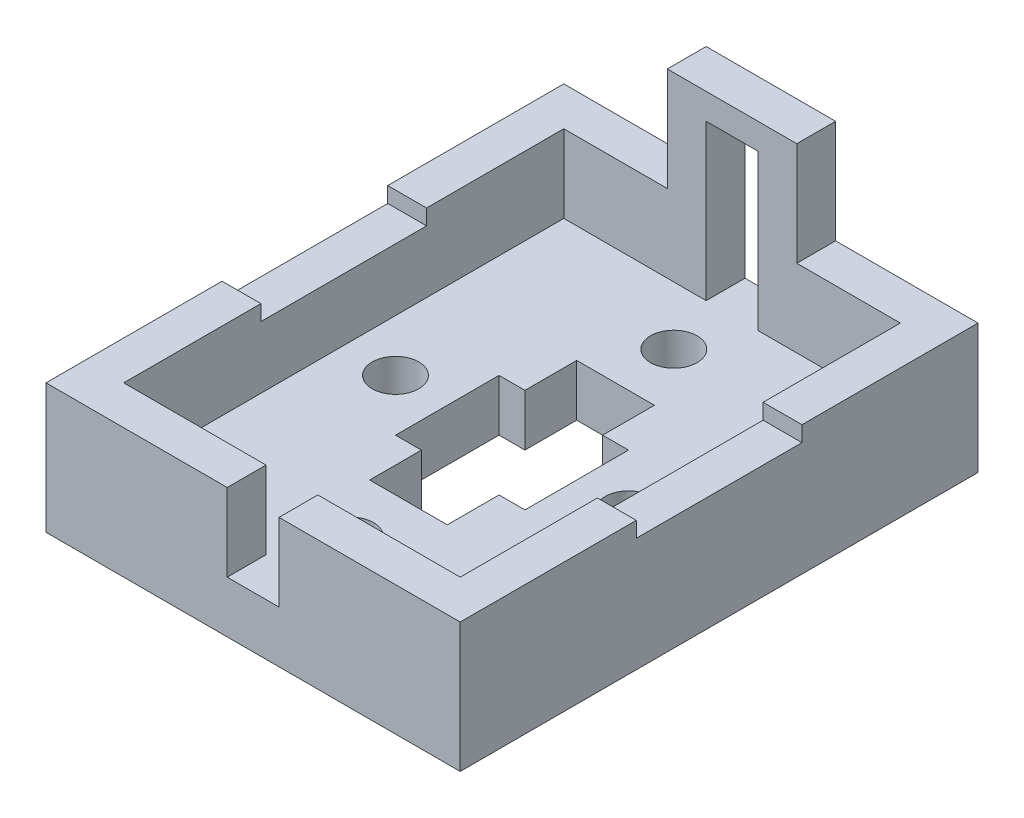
ISO-10303-21;
HEADER;
FILE_DESCRIPTION(('STEP AP214'),'2;1');
FILE_NAME('part.step','',(''),(''),'','','');
FILE_SCHEMA(('AUTOMOTIVE_DESIGN { 1 0 10303 214 1 1 1 1 }'));
ENDSEC;
DATA;
#1=APPLICATION_CONTEXT('core data for automotive mechanical design processes');
#2=APPLICATION_PROTOCOL_DEFINITION('international standard','automotive_design',2000,#1);
#3=PRODUCT_CONTEXT('',#1,'mechanical');
#4=PRODUCT('Part','Part','',(#3));
#5=PRODUCT_RELATED_PRODUCT_CATEGORY('part','',(#4));
#6=PRODUCT_DEFINITION_FORMATION('','',#4);
#7=PRODUCT_DEFINITION_CONTEXT('part definition',#1,'design');
#8=PRODUCT_DEFINITION('design','',#6,#7);
#9=PRODUCT_DEFINITION_SHAPE('','',#8);
#10=(LENGTH_UNIT() NAMED_UNIT(*) SI_UNIT(.MILLI.,.METRE.));
#11=(NAMED_UNIT(*) PLANE_ANGLE_UNIT() SI_UNIT($,.RADIAN.));
#12=(NAMED_UNIT(*) SI_UNIT($,.STERADIAN.) SOLID_ANGLE_UNIT());
#13=UNCERTAINTY_MEASURE_WITH_UNIT(LENGTH_MEASURE(1.E-05),#10,'distance_accuracy_value','');
#14=(GEOMETRIC_REPRESENTATION_CONTEXT(3) GLOBAL_UNCERTAINTY_ASSIGNED_CONTEXT((#13)) GLOBAL_UNIT_ASSIGNED_CONTEXT((#10,
#11,#12)) REPRESENTATION_CONTEXT('',''));
#15=CARTESIAN_POINT('',(0.,0.,0.));
#16=DIRECTION('',(0.,0.,1.));
#17=DIRECTION('',(1.,0.,0.));
#18=AXIS2_PLACEMENT_3D('',#15,#16,#17);
#19=CARTESIAN_POINT('',(0.,25.,-100.));
#20=DIRECTION('',(0.,-1.,0.));
#21=DIRECTION('',(0.,0.,-1.));
#22=AXIS2_PLACEMENT_3D('',#19,#20,#21);
#23=PLANE('',#22);
#24=DIRECTION('',(0.,0.,-1.));
#25=VECTOR('',#24,1.);
#26=CARTESIAN_POINT('',(35.,25.,-50.));
#27=LINE('',#26,#25);
#28=CARTESIAN_POINT('',(35.,25.,0.));
#29=VERTEX_POINT('',#28);
#30=CARTESIAN_POINT('',(35.,25.,-7.5));
#31=VERTEX_POINT('',#30);
#32=EDGE_CURVE('E530',#29,#31,#27,.T.);
#33=ORIENTED_EDGE('',*,*,#32,.T.);
#34=DIRECTION('',(1.,0.,0.));
#35=VECTOR('',#34,1.);
#36=CARTESIAN_POINT('',(7.5,25.,-7.5));
#37=LINE('',#36,#35);
#38=CARTESIAN_POINT('',(7.5,25.,-7.5));
#39=VERTEX_POINT('',#38);
#40=EDGE_CURVE('E392',#39,#31,#37,.T.);
#41=ORIENTED_EDGE('',*,*,#40,.F.);
#42=DIRECTION('',(0.,0.,1.));
#43=VECTOR('',#42,1.);
#44=CARTESIAN_POINT('',(7.5,25.,-92.5));
#45=LINE('',#44,#43);
#46=CARTESIAN_POINT('',(7.50000000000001,25.,-34.));
#47=VERTEX_POINT('',#46);
#48=EDGE_CURVE('E391',#47,#39,#45,.T.);
#49=ORIENTED_EDGE('',*,*,#48,.F.);
#50=DIRECTION('',(1.,0.,0.));
#51=VECTOR('',#50,1.);
#52=CARTESIAN_POINT('',(-59.7506578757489,25.,-34.));
#53=LINE('',#52,#51);
#54=CARTESIAN_POINT('',(0.,25.,-34.));
#55=VERTEX_POINT('',#54);
#56=EDGE_CURVE('E438',#55,#47,#53,.T.);
#57=ORIENTED_EDGE('',*,*,#56,.F.);
#58=DIRECTION('',(0.,0.,1.));
#59=VECTOR('',#58,1.);
#60=CARTESIAN_POINT('',(0.,25.,0.));
#61=LINE('',#60,#59);
#62=CARTESIAN_POINT('',(0.,25.,0.));
#63=VERTEX_POINT('',#62);
#64=EDGE_CURVE('E354',#55,#63,#61,.T.);
#65=ORIENTED_EDGE('',*,*,#64,.T.);
#66=DIRECTION('',(1.,0.,0.));
#67=VECTOR('',#66,1.);
#68=CARTESIAN_POINT('',(0.,25.,0.));
#69=LINE('',#68,#67);
#70=EDGE_CURVE('E359',#63,#29,#69,.T.);
#71=ORIENTED_EDGE('',*,*,#70,.T.);
#72=EDGE_LOOP('',(#33,#41,#49,#57,#65,#71));
#73=FACE_BOUND('',#72,.T.);
#74=ADVANCED_FACE('F37',(#73),#23,.F.);
#75=CARTESIAN_POINT('',(0.,25.,0.));
#76=DIRECTION('',(0.,0.,-1.));
#77=DIRECTION('',(-1.,0.,0.));
#78=AXIS2_PLACEMENT_3D('',#75,#76,#77);
#79=PLANE('',#78);
#80=DIRECTION('',(0.,1.,0.));
#81=VECTOR('',#80,1.);
#82=CARTESIAN_POINT('',(35.,10.,0.));
#83=LINE('',#82,#81);
#84=CARTESIAN_POINT('',(35.,10.,0.));
#85=VERTEX_POINT('',#84);
#86=EDGE_CURVE('E425',#85,#29,#83,.T.);
#87=ORIENTED_EDGE('',*,*,#86,.T.);
#88=ORIENTED_EDGE('',*,*,#70,.F.);
#89=DIRECTION('',(0.,-1.,0.));
#90=VECTOR('',#89,1.);
#91=CARTESIAN_POINT('',(0.,25.,0.));
#92=LINE('',#91,#90);
#93=CARTESIAN_POINT('',(0.,0.,0.));
#94=VERTEX_POINT('',#93);
#95=EDGE_CURVE('E11',#63,#94,#92,.T.);
#96=ORIENTED_EDGE('',*,*,#95,.T.);
#97=DIRECTION('',(1.,0.,0.));
#98=VECTOR('',#97,1.);
#99=CARTESIAN_POINT('',(0.,0.,0.));
#100=LINE('',#99,#98);
#101=CARTESIAN_POINT('',(80.,0.,0.));
#102=VERTEX_POINT('',#101);
#103=EDGE_CURVE('E348',#94,#102,#100,.T.);
#104=ORIENTED_EDGE('',*,*,#103,.T.);
#105=DIRECTION('',(0.,-1.,0.));
#106=VECTOR('',#105,1.);
#107=CARTESIAN_POINT('',(80.,25.,0.));
#108=LINE('',#107,#106);
#109=CARTESIAN_POINT('',(80.,25.,0.));
#110=VERTEX_POINT('',#109);
#111=EDGE_CURVE('E46',#110,#102,#108,.T.);
#112=ORIENTED_EDGE('',*,*,#111,.F.);
#113=CARTESIAN_POINT('',(45.,25.,0.));
#114=VERTEX_POINT('',#113);
#115=EDGE_CURVE('E358',#114,#110,#69,.T.);
#116=ORIENTED_EDGE('',*,*,#115,.F.);
#117=DIRECTION('',(0.,1.,0.));
#118=VECTOR('',#117,1.);
#119=CARTESIAN_POINT('',(45.,10.,0.));
#120=LINE('',#119,#118);
#121=CARTESIAN_POINT('',(45.,10.,0.));
#122=VERTEX_POINT('',#121);
#123=EDGE_CURVE('E547',#122,#114,#120,.T.);
#124=ORIENTED_EDGE('',*,*,#123,.F.);
#125=DIRECTION('',(1.,0.,0.));
#126=VECTOR('',#125,1.);
#127=CARTESIAN_POINT('',(-59.7506578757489,10.,0.));
#128=LINE('',#127,#126);
#129=EDGE_CURVE('E534',#85,#122,#128,.T.);
#130=ORIENTED_EDGE('',*,*,#129,.F.);
#131=EDGE_LOOP('',(#87,#88,#96,#104,#112,#116,#124,#130));
#132=FACE_BOUND('',#131,.T.);
#133=ADVANCED_FACE('F558',(#132),#79,.F.);
#134=CARTESIAN_POINT('',(7.5,10.,-7.5));
#135=DIRECTION('',(0.,0.,1.));
#136=DIRECTION('',(1.,0.,0.));
#137=AXIS2_PLACEMENT_3D('',#134,#135,#136);
#138=PLANE('',#137);
#139=DIRECTION('',(0.,1.,0.));
#140=VECTOR('',#139,1.);
#141=CARTESIAN_POINT('',(35.,10.,-7.5));
#142=LINE('',#141,#140);
#143=CARTESIAN_POINT('',(35.,10.,-7.5));
#144=VERTEX_POINT('',#143);
#145=EDGE_CURVE('E549',#144,#31,#142,.T.);
#146=ORIENTED_EDGE('',*,*,#145,.F.);
#147=DIRECTION('',(1.,0.,0.));
#148=VECTOR('',#147,1.);
#149=CARTESIAN_POINT('',(7.5,10.,-7.5));
#150=LINE('',#149,#148);
#151=CARTESIAN_POINT('',(7.5,10.,-7.5));
#152=VERTEX_POINT('',#151);
#153=EDGE_CURVE('E330',#152,#144,#150,.T.);
#154=ORIENTED_EDGE('',*,*,#153,.F.);
#155=DIRECTION('',(0.,1.,0.));
#156=VECTOR('',#155,1.);
#157=CARTESIAN_POINT('',(7.5,10.,-7.5));
#158=LINE('',#157,#156);
#159=EDGE_CURVE('E341',#152,#39,#158,.T.);
#160=ORIENTED_EDGE('',*,*,#159,.T.);
#161=ORIENTED_EDGE('',*,*,#40,.T.);
#162=EDGE_LOOP('',(#146,#154,#160,#161));
#163=FACE_BOUND('',#162,.T.);
#164=ADVANCED_FACE('F528',(#163),#138,.F.);
#165=CARTESIAN_POINT('',(45.,25.,-7.5));
#166=VERTEX_POINT('',#165);
#167=CARTESIAN_POINT('',(72.5,25.,-7.5));
#168=VERTEX_POINT('',#167);
#169=EDGE_CURVE('E390',#166,#168,#37,.T.);
#170=ORIENTED_EDGE('',*,*,#169,.F.);
#171=DIRECTION('',(0.,0.,-1.));
#172=VECTOR('',#171,1.);
#173=CARTESIAN_POINT('',(45.,25.,-50.));
#174=LINE('',#173,#172);
#175=EDGE_CURVE('E535',#114,#166,#174,.T.);
#176=ORIENTED_EDGE('',*,*,#175,.F.);
#177=ORIENTED_EDGE('',*,*,#115,.T.);
#178=DIRECTION('',(0.,0.,-1.));
#179=VECTOR('',#178,1.);
#180=CARTESIAN_POINT('',(80.,25.,0.));
#181=LINE('',#180,#179);
#182=CARTESIAN_POINT('',(80.,25.,-34.));
#183=VERTEX_POINT('',#182);
#184=EDGE_CURVE('E363',#110,#183,#181,.T.);
#185=ORIENTED_EDGE('',*,*,#184,.T.);
#186=DIRECTION('',(-1.,0.,0.));
#187=VECTOR('',#186,1.);
#188=CARTESIAN_POINT('',(-59.7506578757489,25.,-34.));
#189=LINE('',#188,#187);
#190=CARTESIAN_POINT('',(72.5,25.,-34.));
#191=VERTEX_POINT('',#190);
#192=EDGE_CURVE('E415',#183,#191,#189,.T.);
#193=ORIENTED_EDGE('',*,*,#192,.T.);
#194=DIRECTION('',(0.,0.,-1.));
#195=VECTOR('',#194,1.);
#196=CARTESIAN_POINT('',(72.5,25.,-7.5));
#197=LINE('',#196,#195);
#198=EDGE_CURVE('E326',#168,#191,#197,.T.);
#199=ORIENTED_EDGE('',*,*,#198,.F.);
#200=EDGE_LOOP('',(#170,#176,#177,#185,#193,#199));
#201=FACE_BOUND('',#200,.T.);
#202=ADVANCED_FACE('F414',(#201),#23,.F.);
#203=CARTESIAN_POINT('',(80.,25.,0.));
#204=DIRECTION('',(-1.,0.,0.));
#205=DIRECTION('',(0.,0.,1.));
#206=AXIS2_PLACEMENT_3D('',#203,#204,#205);
#207=PLANE('',#206);
#208=DIRECTION('',(0.,1.,0.));
#209=VECTOR('',#208,1.);
#210=CARTESIAN_POINT('',(80.,22.,-34.));
#211=LINE('',#210,#209);
#212=CARTESIAN_POINT('',(80.,22.,-34.));
#213=VERTEX_POINT('',#212);
#214=EDGE_CURVE('E436',#213,#183,#211,.T.);
#215=ORIENTED_EDGE('',*,*,#214,.T.);
#216=ORIENTED_EDGE('',*,*,#184,.F.);
#217=ORIENTED_EDGE('',*,*,#111,.T.);
#218=DIRECTION('',(0.,0.,-1.));
#219=VECTOR('',#218,1.);
#220=CARTESIAN_POINT('',(80.,0.,0.));
#221=LINE('',#220,#219);
#222=CARTESIAN_POINT('',(80.,0.,-100.));
#223=VERTEX_POINT('',#222);
#224=EDGE_CURVE('E350',#102,#223,#221,.T.);
#225=ORIENTED_EDGE('',*,*,#224,.T.);
#226=DIRECTION('',(0.,-1.,0.));
#227=VECTOR('',#226,1.);
#228=CARTESIAN_POINT('',(80.,25.,-100.));
#229=LINE('',#228,#227);
#230=CARTESIAN_POINT('',(80.,25.,-100.));
#231=VERTEX_POINT('',#230);
#232=EDGE_CURVE('E562',#231,#223,#229,.T.);
#233=ORIENTED_EDGE('',*,*,#232,.F.);
#234=CARTESIAN_POINT('',(80.,25.,-66.));
#235=VERTEX_POINT('',#234);
#236=EDGE_CURVE('E362',#235,#231,#181,.T.);
#237=ORIENTED_EDGE('',*,*,#236,.F.);
#238=DIRECTION('',(0.,1.,0.));
#239=VECTOR('',#238,1.);
#240=CARTESIAN_POINT('',(80.,22.,-66.));
#241=LINE('',#240,#239);
#242=CARTESIAN_POINT('',(80.,22.,-66.));
#243=VERTEX_POINT('',#242);
#244=EDGE_CURVE('E435',#243,#235,#241,.T.);
#245=ORIENTED_EDGE('',*,*,#244,.F.);
#246=DIRECTION('',(0.,0.,-1.));
#247=VECTOR('',#246,1.);
#248=CARTESIAN_POINT('',(80.,22.,-50.));
#249=LINE('',#248,#247);
#250=EDGE_CURVE('E419',#213,#243,#249,.T.);
#251=ORIENTED_EDGE('',*,*,#250,.F.);
#252=EDGE_LOOP('',(#215,#216,#217,#225,#233,#237,#245,#251));
#253=FACE_BOUND('',#252,.T.);
#254=ADVANCED_FACE('F564',(#253),#207,.F.);
#255=CARTESIAN_POINT('',(72.5,10.,-7.5));
#256=DIRECTION('',(1.,0.,0.));
#257=DIRECTION('',(0.,0.,-1.));
#258=AXIS2_PLACEMENT_3D('',#255,#256,#257);
#259=PLANE('',#258);
#260=DIRECTION('',(0.,1.,0.));
#261=VECTOR('',#260,1.);
#262=CARTESIAN_POINT('',(72.5,22.,-34.));
#263=LINE('',#262,#261);
#264=CARTESIAN_POINT('',(72.5,22.,-34.));
#265=VERTEX_POINT('',#264);
#266=EDGE_CURVE('E439',#265,#191,#263,.T.);
#267=ORIENTED_EDGE('',*,*,#266,.F.);
#268=DIRECTION('',(0.,0.,-1.));
#269=VECTOR('',#268,1.);
#270=CARTESIAN_POINT('',(72.5,22.,-50.));
#271=LINE('',#270,#269);
#272=CARTESIAN_POINT('',(72.5,22.,-66.));
#273=VERTEX_POINT('',#272);
#274=EDGE_CURVE('E430',#265,#273,#271,.T.);
#275=ORIENTED_EDGE('',*,*,#274,.T.);
#276=DIRECTION('',(0.,1.,0.));
#277=VECTOR('',#276,1.);
#278=CARTESIAN_POINT('',(72.5,22.,-66.));
#279=LINE('',#278,#277);
#280=CARTESIAN_POINT('',(72.5,25.,-66.));
#281=VERTEX_POINT('',#280);
#282=EDGE_CURVE('E441',#273,#281,#279,.T.);
#283=ORIENTED_EDGE('',*,*,#282,.T.);
#284=CARTESIAN_POINT('',(72.5,25.,-92.5));
#285=VERTEX_POINT('',#284);
#286=EDGE_CURVE('E394',#281,#285,#197,.T.);
#287=ORIENTED_EDGE('',*,*,#286,.T.);
#288=DIRECTION('',(0.,1.,0.));
#289=VECTOR('',#288,1.);
#290=CARTESIAN_POINT('',(72.5,10.,-92.5));
#291=LINE('',#290,#289);
#292=CARTESIAN_POINT('',(72.5,10.,-92.5));
#293=VERTEX_POINT('',#292);
#294=EDGE_CURVE('E335',#293,#285,#291,.T.);
#295=ORIENTED_EDGE('',*,*,#294,.F.);
#296=DIRECTION('',(0.,0.,-1.));
#297=VECTOR('',#296,1.);
#298=CARTESIAN_POINT('',(72.5,10.,-7.5));
#299=LINE('',#298,#297);
#300=CARTESIAN_POINT('',(72.5,10.,-7.5));
#301=VERTEX_POINT('',#300);
#302=EDGE_CURVE('E319',#301,#293,#299,.T.);
#303=ORIENTED_EDGE('',*,*,#302,.F.);
#304=DIRECTION('',(0.,1.,0.));
#305=VECTOR('',#304,1.);
#306=CARTESIAN_POINT('',(72.5,10.,-7.5));
#307=LINE('',#306,#305);
#308=EDGE_CURVE('E338',#301,#168,#307,.T.);
#309=ORIENTED_EDGE('',*,*,#308,.T.);
#310=ORIENTED_EDGE('',*,*,#198,.T.);
#311=EDGE_LOOP('',(#267,#275,#283,#287,#295,#303,#309,#310));
#312=FACE_BOUND('',#311,.T.);
#313=ADVANCED_FACE('F412',(#312),#259,.F.);
#314=DIRECTION('',(1.,0.,0.));
#315=VECTOR('',#314,1.);
#316=CARTESIAN_POINT('',(-59.7506578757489,25.,-66.));
#317=LINE('',#316,#315);
#318=CARTESIAN_POINT('',(0.,25.,-66.));
#319=VERTEX_POINT('',#318);
#320=CARTESIAN_POINT('',(7.50000000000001,25.,-66.));
#321=VERTEX_POINT('',#320);
#322=EDGE_CURVE('E446',#319,#321,#317,.T.);
#323=ORIENTED_EDGE('',*,*,#322,.T.);
#324=CARTESIAN_POINT('',(7.5,25.,-92.5));
#325=VERTEX_POINT('',#324);
#326=EDGE_CURVE('E387',#325,#321,#45,.T.);
#327=ORIENTED_EDGE('',*,*,#326,.F.);
#328=DIRECTION('',(-1.,0.,0.));
#329=VECTOR('',#328,1.);
#330=CARTESIAN_POINT('',(72.5,25.,-92.5));
#331=LINE('',#330,#329);
#332=CARTESIAN_POINT('',(27.5,25.,-92.5));
#333=VERTEX_POINT('',#332);
#334=EDGE_CURVE('E377',#333,#325,#331,.T.);
#335=ORIENTED_EDGE('',*,*,#334,.F.);
#336=DIRECTION('',(0.,0.,1.));
#337=VECTOR('',#336,1.);
#338=CARTESIAN_POINT('',(27.5,25.,-100.));
#339=LINE('',#338,#337);
#340=CARTESIAN_POINT('',(27.5,25.,-100.));
#341=VERTEX_POINT('',#340);
#342=EDGE_CURVE('E477',#341,#333,#339,.T.);
#343=ORIENTED_EDGE('',*,*,#342,.F.);
#344=DIRECTION('',(-1.,0.,0.));
#345=VECTOR('',#344,1.);
#346=CARTESIAN_POINT('',(0.,25.,-100.));
#347=LINE('',#346,#345);
#348=CARTESIAN_POINT('',(0.,25.,-100.));
#349=VERTEX_POINT('',#348);
#350=EDGE_CURVE('E366',#341,#349,#347,.T.);
#351=ORIENTED_EDGE('',*,*,#350,.T.);
#352=EDGE_CURVE('E355',#349,#319,#61,.T.);
#353=ORIENTED_EDGE('',*,*,#352,.T.);
#354=EDGE_LOOP('',(#323,#327,#335,#343,#351,#353));
#355=FACE_BOUND('',#354,.T.);
#356=ADVANCED_FACE('F598',(#355),#23,.F.);
#357=CARTESIAN_POINT('',(0.,25.,0.));
#358=DIRECTION('',(1.,0.,0.));
#359=DIRECTION('',(0.,0.,-1.));
#360=AXIS2_PLACEMENT_3D('',#357,#358,#359);
#361=PLANE('',#360);
#362=DIRECTION('',(0.,1.,0.));
#363=VECTOR('',#362,1.);
#364=CARTESIAN_POINT('',(0.,22.,-66.));
#365=LINE('',#364,#363);
#366=CARTESIAN_POINT('',(0.,22.,-66.));
#367=VERTEX_POINT('',#366);
#368=EDGE_CURVE('E460',#367,#319,#365,.T.);
#369=ORIENTED_EDGE('',*,*,#368,.T.);
#370=ORIENTED_EDGE('',*,*,#352,.F.);
#371=DIRECTION('',(0.,-1.,0.));
#372=VECTOR('',#371,1.);
#373=CARTESIAN_POINT('',(0.,25.,-100.));
#374=LINE('',#373,#372);
#375=CARTESIAN_POINT('',(0.,0.,-100.));
#376=VERTEX_POINT('',#375);
#377=EDGE_CURVE('E369',#349,#376,#374,.T.);
#378=ORIENTED_EDGE('',*,*,#377,.T.);
#379=DIRECTION('',(0.,0.,1.));
#380=VECTOR('',#379,1.);
#381=CARTESIAN_POINT('',(0.,0.,0.));
#382=LINE('',#381,#380);
#383=EDGE_CURVE('E337',#376,#94,#382,.T.);
#384=ORIENTED_EDGE('',*,*,#383,.T.);
#385=ORIENTED_EDGE('',*,*,#95,.F.);
#386=ORIENTED_EDGE('',*,*,#64,.F.);
#387=DIRECTION('',(0.,1.,0.));
#388=VECTOR('',#387,1.);
#389=CARTESIAN_POINT('',(0.,22.,-34.));
#390=LINE('',#389,#388);
#391=CARTESIAN_POINT('',(0.,22.,-34.));
#392=VERTEX_POINT('',#391);
#393=EDGE_CURVE('E459',#392,#55,#390,.T.);
#394=ORIENTED_EDGE('',*,*,#393,.F.);
#395=DIRECTION('',(0.,0.,1.));
#396=VECTOR('',#395,1.);
#397=CARTESIAN_POINT('',(0.,22.,-50.));
#398=LINE('',#397,#396);
#399=EDGE_CURVE('E449',#367,#392,#398,.T.);
#400=ORIENTED_EDGE('',*,*,#399,.F.);
#401=EDGE_LOOP('',(#369,#370,#378,#384,#385,#386,#394,#400));
#402=FACE_BOUND('',#401,.T.);
#403=ADVANCED_FACE('F39',(#402),#361,.F.);
#404=CARTESIAN_POINT('',(7.5,10.,-92.5));
#405=DIRECTION('',(-1.,0.,0.));
#406=DIRECTION('',(0.,0.,1.));
#407=AXIS2_PLACEMENT_3D('',#404,#405,#406);
#408=PLANE('',#407);
#409=DIRECTION('',(0.,1.,0.));
#410=VECTOR('',#409,1.);
#411=CARTESIAN_POINT('',(7.50000000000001,22.,-66.));
#412=LINE('',#411,#410);
#413=CARTESIAN_POINT('',(7.50000000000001,22.,-66.));
#414=VERTEX_POINT('',#413);
#415=EDGE_CURVE('E464',#414,#321,#412,.T.);
#416=ORIENTED_EDGE('',*,*,#415,.F.);
#417=DIRECTION('',(0.,0.,1.));
#418=VECTOR('',#417,1.);
#419=CARTESIAN_POINT('',(7.50000000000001,22.,-50.));
#420=LINE('',#419,#418);
#421=CARTESIAN_POINT('',(7.5,22.,-34.));
#422=VERTEX_POINT('',#421);
#423=EDGE_CURVE('E454',#414,#422,#420,.T.);
#424=ORIENTED_EDGE('',*,*,#423,.T.);
#425=DIRECTION('',(0.,1.,0.));
#426=VECTOR('',#425,1.);
#427=CARTESIAN_POINT('',(7.50000000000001,22.,-34.));
#428=LINE('',#427,#426);
#429=EDGE_CURVE('E466',#422,#47,#428,.T.);
#430=ORIENTED_EDGE('',*,*,#429,.T.);
#431=ORIENTED_EDGE('',*,*,#48,.T.);
#432=ORIENTED_EDGE('',*,*,#159,.F.);
#433=DIRECTION('',(0.,0.,1.));
#434=VECTOR('',#433,1.);
#435=CARTESIAN_POINT('',(7.5,10.,-92.5));
#436=LINE('',#435,#434);
#437=CARTESIAN_POINT('',(7.5,10.,-92.5));
#438=VERTEX_POINT('',#437);
#439=EDGE_CURVE('E320',#438,#152,#436,.T.);
#440=ORIENTED_EDGE('',*,*,#439,.F.);
#441=DIRECTION('',(0.,1.,0.));
#442=VECTOR('',#441,1.);
#443=CARTESIAN_POINT('',(7.5,10.,-92.5));
#444=LINE('',#443,#442);
#445=EDGE_CURVE('E334',#438,#325,#444,.T.);
#446=ORIENTED_EDGE('',*,*,#445,.T.);
#447=ORIENTED_EDGE('',*,*,#326,.T.);
#448=EDGE_LOOP('',(#416,#424,#430,#431,#432,#440,#446,#447));
#449=FACE_BOUND('',#448,.T.);
#450=ADVANCED_FACE('F522',(#449),#408,.F.);
#451=ORIENTED_EDGE('',*,*,#286,.F.);
#452=DIRECTION('',(-1.,0.,0.));
#453=VECTOR('',#452,1.);
#454=CARTESIAN_POINT('',(-59.7506578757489,25.,-66.));
#455=LINE('',#454,#453);
#456=EDGE_CURVE('E420',#235,#281,#455,.T.);
#457=ORIENTED_EDGE('',*,*,#456,.F.);
#458=ORIENTED_EDGE('',*,*,#236,.T.);
#459=CARTESIAN_POINT('',(52.5,25.,-100.));
#460=VERTEX_POINT('',#459);
#461=EDGE_CURVE('E375',#231,#460,#347,.T.);
#462=ORIENTED_EDGE('',*,*,#461,.T.);
#463=DIRECTION('',(0.,0.,-1.));
#464=VECTOR('',#463,1.);
#465=CARTESIAN_POINT('',(52.5,25.,-100.));
#466=LINE('',#465,#464);
#467=CARTESIAN_POINT('',(52.5,25.,-92.5));
#468=VERTEX_POINT('',#467);
#469=EDGE_CURVE('E463',#468,#460,#466,.T.);
#470=ORIENTED_EDGE('',*,*,#469,.F.);
#471=EDGE_CURVE('E380',#285,#468,#331,.T.);
#472=ORIENTED_EDGE('',*,*,#471,.F.);
#473=EDGE_LOOP('',(#451,#457,#458,#462,#470,#472));
#474=FACE_BOUND('',#473,.T.);
#475=ADVANCED_FACE('F518',(#474),#23,.F.);
#476=CARTESIAN_POINT('',(0.,25.,-100.));
#477=DIRECTION('',(0.,0.,1.));
#478=DIRECTION('',(1.,0.,0.));
#479=AXIS2_PLACEMENT_3D('',#476,#477,#478);
#480=PLANE('',#479);
#481=DIRECTION('',(0.,-1.,0.));
#482=VECTOR('',#481,1.);
#483=CARTESIAN_POINT('',(35.,25.,-100.));
#484=LINE('',#483,#482);
#485=CARTESIAN_POINT('',(35.,40.,-100.));
#486=VERTEX_POINT('',#485);
#487=CARTESIAN_POINT('',(35.,10.,-100.));
#488=VERTEX_POINT('',#487);
#489=EDGE_CURVE('E615',#486,#488,#484,.T.);
#490=ORIENTED_EDGE('',*,*,#489,.T.);
#491=DIRECTION('',(1.,0.,0.));
#492=VECTOR('',#491,1.);
#493=CARTESIAN_POINT('',(0.,10.,-100.));
#494=LINE('',#493,#492);
#495=CARTESIAN_POINT('',(45.,10.,-100.));
#496=VERTEX_POINT('',#495);
#497=EDGE_CURVE('E618',#488,#496,#494,.T.);
#498=ORIENTED_EDGE('',*,*,#497,.T.);
#499=DIRECTION('',(0.,1.,0.));
#500=VECTOR('',#499,1.);
#501=CARTESIAN_POINT('',(45.,25.,-100.));
#502=LINE('',#501,#500);
#503=CARTESIAN_POINT('',(45.,40.,-100.));
#504=VERTEX_POINT('',#503);
#505=EDGE_CURVE('E301',#496,#504,#502,.T.);
#506=ORIENTED_EDGE('',*,*,#505,.T.);
#507=DIRECTION('',(-1.,0.,0.));
#508=VECTOR('',#507,1.);
#509=CARTESIAN_POINT('',(0.,40.,-100.));
#510=LINE('',#509,#508);
#511=EDGE_CURVE('E612',#504,#486,#510,.T.);
#512=ORIENTED_EDGE('',*,*,#511,.T.);
#513=EDGE_LOOP('',(#490,#498,#506,#512));
#514=FACE_BOUND('',#513,.T.);
#515=DIRECTION('',(-1.,0.,0.));
#516=VECTOR('',#515,1.);
#517=CARTESIAN_POINT('',(0.,0.,-100.));
#518=LINE('',#517,#516);
#519=EDGE_CURVE('E352',#223,#376,#518,.T.);
#520=ORIENTED_EDGE('',*,*,#519,.T.);
#521=ORIENTED_EDGE('',*,*,#377,.F.);
#522=ORIENTED_EDGE('',*,*,#350,.F.);
#523=DIRECTION('',(0.,-1.,0.));
#524=VECTOR('',#523,1.);
#525=CARTESIAN_POINT('',(27.5,45.,-100.));
#526=LINE('',#525,#524);
#527=CARTESIAN_POINT('',(27.5,45.,-100.));
#528=VERTEX_POINT('',#527);
#529=EDGE_CURVE('E487',#528,#341,#526,.T.);
#530=ORIENTED_EDGE('',*,*,#529,.F.);
#531=DIRECTION('',(-1.,0.,0.));
#532=VECTOR('',#531,1.);
#533=CARTESIAN_POINT('',(52.5,45.,-100.));
#534=LINE('',#533,#532);
#535=CARTESIAN_POINT('',(52.5,45.,-100.));
#536=VERTEX_POINT('',#535);
#537=EDGE_CURVE('E493',#536,#528,#534,.T.);
#538=ORIENTED_EDGE('',*,*,#537,.F.);
#539=DIRECTION('',(0.,-1.,0.));
#540=VECTOR('',#539,1.);
#541=CARTESIAN_POINT('',(52.5,45.,-100.));
#542=LINE('',#541,#540);
#543=EDGE_CURVE('E381',#536,#460,#542,.T.);
#544=ORIENTED_EDGE('',*,*,#543,.T.);
#545=ORIENTED_EDGE('',*,*,#461,.F.);
#546=ORIENTED_EDGE('',*,*,#232,.T.);
#547=EDGE_LOOP('',(#520,#521,#522,#530,#538,#544,#545,#546));
#548=FACE_BOUND('',#547,.T.);
#549=ADVANCED_FACE('F510',(#514,#548),#480,.F.);
#550=CARTESIAN_POINT('',(0.,0.,-100.));
#551=DIRECTION('',(0.,-1.,0.));
#552=DIRECTION('',(0.,0.,-1.));
#553=AXIS2_PLACEMENT_3D('',#550,#551,#552);
#554=PLANE('',#553);
#555=CARTESIAN_POINT('',(17.5,0.,-50.));
#556=DIRECTION('',(0.,-1.,0.));
#557=DIRECTION('',(0.,0.,-1.));
#558=AXIS2_PLACEMENT_3D('',#555,#556,#557);
#559=CIRCLE('',#558,4.5);
#560=CARTESIAN_POINT('',(17.5,0.,-54.5));
#561=VERTEX_POINT('',#560);
#562=EDGE_CURVE('E809',#561,#561,#559,.T.);
#563=ORIENTED_EDGE('',*,*,#562,.F.);
#564=EDGE_LOOP('',(#563));
#565=FACE_BOUND('',#564,.T.);
#566=CARTESIAN_POINT('',(40.,0.,-81.25));
#567=DIRECTION('',(0.,-1.,0.));
#568=DIRECTION('',(0.,0.,-1.));
#569=AXIS2_PLACEMENT_3D('',#566,#567,#568);
#570=CIRCLE('',#569,4.5);
#571=CARTESIAN_POINT('',(40.,0.,-85.75));
#572=VERTEX_POINT('',#571);
#573=EDGE_CURVE('E813',#572,#572,#570,.T.);
#574=ORIENTED_EDGE('',*,*,#573,.F.);
#575=EDGE_LOOP('',(#574));
#576=FACE_BOUND('',#575,.T.);
#577=CARTESIAN_POINT('',(62.5,0.,-50.));
#578=DIRECTION('',(0.,-1.,0.));
#579=DIRECTION('',(0.,0.,-1.));
#580=AXIS2_PLACEMENT_3D('',#577,#578,#579);
#581=CIRCLE('',#580,4.5);
#582=CARTESIAN_POINT('',(62.5,0.,-54.5));
#583=VERTEX_POINT('',#582);
#584=EDGE_CURVE('E817',#583,#583,#581,.T.);
#585=ORIENTED_EDGE('',*,*,#584,.F.);
#586=EDGE_LOOP('',(#585));
#587=FACE_BOUND('',#586,.T.);
#588=CARTESIAN_POINT('',(40.,0.,-18.75));
#589=DIRECTION('',(0.,-1.,0.));
#590=DIRECTION('',(0.,0.,-1.));
#591=AXIS2_PLACEMENT_3D('',#588,#589,#590);
#592=CIRCLE('',#591,4.5);
#593=CARTESIAN_POINT('',(40.,0.,-23.25));
#594=VERTEX_POINT('',#593);
#595=EDGE_CURVE('E315',#594,#594,#592,.T.);
#596=ORIENTED_EDGE('',*,*,#595,.F.);
#597=EDGE_LOOP('',(#596));
#598=FACE_BOUND('',#597,.T.);
#599=DIRECTION('',(-1.,0.,0.));
#600=VECTOR('',#599,1.);
#601=CARTESIAN_POINT('',(27.5,0.,-60.));
#602=LINE('',#601,#600);
#603=CARTESIAN_POINT('',(32.5,0.,-60.));
#604=VERTEX_POINT('',#603);
#605=CARTESIAN_POINT('',(27.5,0.,-60.));
#606=VERTEX_POINT('',#605);
#607=EDGE_CURVE('E655',#604,#606,#602,.T.);
#608=ORIENTED_EDGE('',*,*,#607,.T.);
#609=DIRECTION('',(0.,0.,1.));
#610=VECTOR('',#609,1.);
#611=CARTESIAN_POINT('',(27.5,0.,-40.));
#612=LINE('',#611,#610);
#613=CARTESIAN_POINT('',(27.5,0.,-40.));
#614=VERTEX_POINT('',#613);
#615=EDGE_CURVE('E658',#606,#614,#612,.T.);
#616=ORIENTED_EDGE('',*,*,#615,.T.);
#617=DIRECTION('',(1.,0.,0.));
#618=VECTOR('',#617,1.);
#619=CARTESIAN_POINT('',(27.5,0.,-40.));
#620=LINE('',#619,#618);
#621=CARTESIAN_POINT('',(32.5,0.,-40.));
#622=VERTEX_POINT('',#621);
#623=EDGE_CURVE('E661',#614,#622,#620,.T.);
#624=ORIENTED_EDGE('',*,*,#623,.T.);
#625=DIRECTION('',(0.,0.,1.));
#626=VECTOR('',#625,1.);
#627=CARTESIAN_POINT('',(32.5,0.,-40.));
#628=LINE('',#627,#626);
#629=CARTESIAN_POINT('',(32.5,0.,-30.));
#630=VERTEX_POINT('',#629);
#631=EDGE_CURVE('E664',#622,#630,#628,.T.);
#632=ORIENTED_EDGE('',*,*,#631,.T.);
#633=DIRECTION('',(1.,0.,0.));
#634=VECTOR('',#633,1.);
#635=CARTESIAN_POINT('',(32.5,0.,-30.));
#636=LINE('',#635,#634);
#637=CARTESIAN_POINT('',(47.5,0.,-30.));
#638=VERTEX_POINT('',#637);
#639=EDGE_CURVE('E667',#630,#638,#636,.T.);
#640=ORIENTED_EDGE('',*,*,#639,.T.);
#641=DIRECTION('',(0.,0.,-1.));
#642=VECTOR('',#641,1.);
#643=CARTESIAN_POINT('',(47.5,0.,-40.));
#644=LINE('',#643,#642);
#645=CARTESIAN_POINT('',(47.5,0.,-40.));
#646=VERTEX_POINT('',#645);
#647=EDGE_CURVE('E670',#638,#646,#644,.T.);
#648=ORIENTED_EDGE('',*,*,#647,.T.);
#649=DIRECTION('',(1.,0.,0.));
#650=VECTOR('',#649,1.);
#651=CARTESIAN_POINT('',(52.5,0.,-40.));
#652=LINE('',#651,#650);
#653=CARTESIAN_POINT('',(52.5,0.,-40.));
#654=VERTEX_POINT('',#653);
#655=EDGE_CURVE('E673',#646,#654,#652,.T.);
#656=ORIENTED_EDGE('',*,*,#655,.T.);
#657=DIRECTION('',(0.,0.,-1.));
#658=VECTOR('',#657,1.);
#659=CARTESIAN_POINT('',(52.5,0.,-40.));
#660=LINE('',#659,#658);
#661=CARTESIAN_POINT('',(52.5,0.,-60.));
#662=VERTEX_POINT('',#661);
#663=EDGE_CURVE('E676',#654,#662,#660,.T.);
#664=ORIENTED_EDGE('',*,*,#663,.T.);
#665=DIRECTION('',(-1.,0.,0.));
#666=VECTOR('',#665,1.);
#667=CARTESIAN_POINT('',(52.5,0.,-60.));
#668=LINE('',#667,#666);
#669=CARTESIAN_POINT('',(47.5,0.,-60.));
#670=VERTEX_POINT('',#669);
#671=EDGE_CURVE('E679',#662,#670,#668,.T.);
#672=ORIENTED_EDGE('',*,*,#671,.T.);
#673=DIRECTION('',(0.,0.,-1.));
#674=VECTOR('',#673,1.);
#675=CARTESIAN_POINT('',(47.5,0.,-60.));
#676=LINE('',#675,#674);
#677=CARTESIAN_POINT('',(47.5,0.,-70.));
#678=VERTEX_POINT('',#677);
#679=EDGE_CURVE('E682',#670,#678,#676,.T.);
#680=ORIENTED_EDGE('',*,*,#679,.T.);
#681=DIRECTION('',(-1.,0.,0.));
#682=VECTOR('',#681,1.);
#683=CARTESIAN_POINT('',(32.5,0.,-70.));
#684=LINE('',#683,#682);
#685=CARTESIAN_POINT('',(32.5,0.,-70.));
#686=VERTEX_POINT('',#685);
#687=EDGE_CURVE('E685',#678,#686,#684,.T.);
#688=ORIENTED_EDGE('',*,*,#687,.T.);
#689=DIRECTION('',(0.,0.,1.));
#690=VECTOR('',#689,1.);
#691=CARTESIAN_POINT('',(32.5,0.,-60.));
#692=LINE('',#691,#690);
#693=EDGE_CURVE('E688',#686,#604,#692,.T.);
#694=ORIENTED_EDGE('',*,*,#693,.T.);
#695=EDGE_LOOP('',(#608,#616,#624,#632,#640,#648,#656,#664,#672,#680,#688,#694));
#696=FACE_BOUND('',#695,.T.);
#697=ORIENTED_EDGE('',*,*,#383,.F.);
#698=ORIENTED_EDGE('',*,*,#519,.F.);
#699=ORIENTED_EDGE('',*,*,#224,.F.);
#700=ORIENTED_EDGE('',*,*,#103,.F.);
#701=EDGE_LOOP('',(#697,#698,#699,#700));
#702=FACE_BOUND('',#701,.T.);
#703=ADVANCED_FACE('F586',(#565,#576,#587,#598,#696,#702),#554,.T.);
#704=CARTESIAN_POINT('',(72.5,10.,-92.5));
#705=DIRECTION('',(0.,0.,-1.));
#706=DIRECTION('',(-1.,0.,0.));
#707=AXIS2_PLACEMENT_3D('',#704,#705,#706);
#708=PLANE('',#707);
#709=DIRECTION('',(-1.,0.,0.));
#710=VECTOR('',#709,1.);
#711=CARTESIAN_POINT('',(72.5,10.,-92.5));
#712=LINE('',#711,#710);
#713=CARTESIAN_POINT('',(35.,10.,-92.5));
#714=VERTEX_POINT('',#713);
#715=EDGE_CURVE('E321',#714,#438,#712,.T.);
#716=ORIENTED_EDGE('',*,*,#715,.F.);
#717=DIRECTION('',(0.,-1.,0.));
#718=VECTOR('',#717,1.);
#719=CARTESIAN_POINT('',(35.,10.,-92.5));
#720=LINE('',#719,#718);
#721=CARTESIAN_POINT('',(35.,40.,-92.5));
#722=VERTEX_POINT('',#721);
#723=EDGE_CURVE('E62',#722,#714,#720,.T.);
#724=ORIENTED_EDGE('',*,*,#723,.F.);
#725=DIRECTION('',(-1.,0.,0.));
#726=VECTOR('',#725,1.);
#727=CARTESIAN_POINT('',(35.,40.,-92.5));
#728=LINE('',#727,#726);
#729=CARTESIAN_POINT('',(45.,40.,-92.5));
#730=VERTEX_POINT('',#729);
#731=EDGE_CURVE('E314',#730,#722,#728,.T.);
#732=ORIENTED_EDGE('',*,*,#731,.F.);
#733=DIRECTION('',(0.,1.,0.));
#734=VECTOR('',#733,1.);
#735=CARTESIAN_POINT('',(45.,10.,-92.5));
#736=LINE('',#735,#734);
#737=CARTESIAN_POINT('',(45.,10.,-92.5));
#738=VERTEX_POINT('',#737);
#739=EDGE_CURVE('E298',#738,#730,#736,.T.);
#740=ORIENTED_EDGE('',*,*,#739,.F.);
#741=EDGE_CURVE('E311',#293,#738,#712,.T.);
#742=ORIENTED_EDGE('',*,*,#741,.F.);
#743=ORIENTED_EDGE('',*,*,#294,.T.);
#744=ORIENTED_EDGE('',*,*,#471,.T.);
#745=DIRECTION('',(0.,-1.,0.));
#746=VECTOR('',#745,1.);
#747=CARTESIAN_POINT('',(52.5,45.,-92.5));
#748=LINE('',#747,#746);
#749=CARTESIAN_POINT('',(52.5,45.,-92.5));
#750=VERTEX_POINT('',#749);
#751=EDGE_CURVE('E480',#750,#468,#748,.T.);
#752=ORIENTED_EDGE('',*,*,#751,.F.);
#753=DIRECTION('',(1.,0.,0.));
#754=VECTOR('',#753,1.);
#755=CARTESIAN_POINT('',(27.5,45.,-92.5));
#756=LINE('',#755,#754);
#757=CARTESIAN_POINT('',(27.5,45.,-92.5));
#758=VERTEX_POINT('',#757);
#759=EDGE_CURVE('E385',#758,#750,#756,.T.);
#760=ORIENTED_EDGE('',*,*,#759,.F.);
#761=DIRECTION('',(0.,-1.,0.));
#762=VECTOR('',#761,1.);
#763=CARTESIAN_POINT('',(27.5,45.,-92.5));
#764=LINE('',#763,#762);
#765=EDGE_CURVE('E482',#758,#333,#764,.T.);
#766=ORIENTED_EDGE('',*,*,#765,.T.);
#767=ORIENTED_EDGE('',*,*,#334,.T.);
#768=ORIENTED_EDGE('',*,*,#445,.F.);
#769=EDGE_LOOP('',(#716,#724,#732,#740,#742,#743,#744,#752,#760,#766,#767,#768));
#770=FACE_BOUND('',#769,.T.);
#771=ADVANCED_FACE('F309',(#770),#708,.F.);
#772=CARTESIAN_POINT('',(45.,10.,-7.5));
#773=VERTEX_POINT('',#772);
#774=EDGE_CURVE('E324',#773,#301,#150,.T.);
#775=ORIENTED_EDGE('',*,*,#774,.F.);
#776=DIRECTION('',(0.,1.,0.));
#777=VECTOR('',#776,1.);
#778=CARTESIAN_POINT('',(45.,10.,-7.5));
#779=LINE('',#778,#777);
#780=EDGE_CURVE('E405',#773,#166,#779,.T.);
#781=ORIENTED_EDGE('',*,*,#780,.T.);
#782=ORIENTED_EDGE('',*,*,#169,.T.);
#783=ORIENTED_EDGE('',*,*,#308,.F.);
#784=EDGE_LOOP('',(#775,#781,#782,#783));
#785=FACE_BOUND('',#784,.T.);
#786=ADVANCED_FACE('F403',(#785),#138,.F.);
#787=CARTESIAN_POINT('',(7.5,10.,-92.5));
#788=DIRECTION('',(0.,1.,0.));
#789=DIRECTION('',(0.,0.,1.));
#790=AXIS2_PLACEMENT_3D('',#787,#788,#789);
#791=PLANE('',#790);
#792=CARTESIAN_POINT('',(17.5,10.,-50.));
#793=DIRECTION('',(0.,1.,0.));
#794=DIRECTION('',(0.,0.,1.));
#795=AXIS2_PLACEMENT_3D('',#792,#793,#794);
#796=CIRCLE('',#795,4.5);
#797=CARTESIAN_POINT('',(17.5,10.,-45.5));
#798=VERTEX_POINT('',#797);
#799=EDGE_CURVE('E835',#798,#798,#796,.T.);
#800=ORIENTED_EDGE('',*,*,#799,.F.);
#801=EDGE_LOOP('',(#800));
#802=FACE_BOUND('',#801,.T.);
#803=CARTESIAN_POINT('',(40.,10.,-81.25));
#804=DIRECTION('',(0.,1.,0.));
#805=DIRECTION('',(0.,0.,1.));
#806=AXIS2_PLACEMENT_3D('',#803,#804,#805);
#807=CIRCLE('',#806,4.5);
#808=CARTESIAN_POINT('',(40.,10.,-76.75));
#809=VERTEX_POINT('',#808);
#810=EDGE_CURVE('E831',#809,#809,#807,.T.);
#811=ORIENTED_EDGE('',*,*,#810,.F.);
#812=EDGE_LOOP('',(#811));
#813=FACE_BOUND('',#812,.T.);
#814=CARTESIAN_POINT('',(62.5,10.,-50.));
#815=DIRECTION('',(0.,1.,0.));
#816=DIRECTION('',(0.,0.,1.));
#817=AXIS2_PLACEMENT_3D('',#814,#815,#816);
#818=CIRCLE('',#817,4.5);
#819=CARTESIAN_POINT('',(62.5,10.,-45.5));
#820=VERTEX_POINT('',#819);
#821=EDGE_CURVE('E827',#820,#820,#818,.T.);
#822=ORIENTED_EDGE('',*,*,#821,.F.);
#823=EDGE_LOOP('',(#822));
#824=FACE_BOUND('',#823,.T.);
#825=CARTESIAN_POINT('',(40.,10.,-18.75));
#826=DIRECTION('',(0.,1.,0.));
#827=DIRECTION('',(0.,0.,1.));
#828=AXIS2_PLACEMENT_3D('',#825,#826,#827);
#829=CIRCLE('',#828,4.5);
#830=CARTESIAN_POINT('',(40.,10.,-14.25));
#831=VERTEX_POINT('',#830);
#832=EDGE_CURVE('E821',#831,#831,#829,.T.);
#833=ORIENTED_EDGE('',*,*,#832,.F.);
#834=EDGE_LOOP('',(#833));
#835=FACE_BOUND('',#834,.T.);
#836=DIRECTION('',(-1.,0.,0.));
#837=VECTOR('',#836,1.);
#838=CARTESIAN_POINT('',(27.5,10.,-60.));
#839=LINE('',#838,#837);
#840=CARTESIAN_POINT('',(32.5,10.,-60.));
#841=VERTEX_POINT('',#840);
#842=CARTESIAN_POINT('',(27.5,10.,-60.));
#843=VERTEX_POINT('',#842);
#844=EDGE_CURVE('E620',#841,#843,#839,.T.);
#845=ORIENTED_EDGE('',*,*,#844,.F.);
#846=DIRECTION('',(0.,0.,1.));
#847=VECTOR('',#846,1.);
#848=CARTESIAN_POINT('',(32.5,10.,-60.));
#849=LINE('',#848,#847);
#850=CARTESIAN_POINT('',(32.5,10.,-70.));
#851=VERTEX_POINT('',#850);
#852=EDGE_CURVE('E652',#851,#841,#849,.T.);
#853=ORIENTED_EDGE('',*,*,#852,.F.);
#854=DIRECTION('',(-1.,0.,0.));
#855=VECTOR('',#854,1.);
#856=CARTESIAN_POINT('',(32.5,10.,-70.));
#857=LINE('',#856,#855);
#858=CARTESIAN_POINT('',(47.5,10.,-70.));
#859=VERTEX_POINT('',#858);
#860=EDGE_CURVE('E649',#859,#851,#857,.T.);
#861=ORIENTED_EDGE('',*,*,#860,.F.);
#862=DIRECTION('',(0.,0.,-1.));
#863=VECTOR('',#862,1.);
#864=CARTESIAN_POINT('',(47.5,10.,-60.));
#865=LINE('',#864,#863);
#866=CARTESIAN_POINT('',(47.5,10.,-60.));
#867=VERTEX_POINT('',#866);
#868=EDGE_CURVE('E646',#867,#859,#865,.T.);
#869=ORIENTED_EDGE('',*,*,#868,.F.);
#870=DIRECTION('',(-1.,0.,0.));
#871=VECTOR('',#870,1.);
#872=CARTESIAN_POINT('',(52.5,10.,-60.));
#873=LINE('',#872,#871);
#874=CARTESIAN_POINT('',(52.5,10.,-60.));
#875=VERTEX_POINT('',#874);
#876=EDGE_CURVE('E643',#875,#867,#873,.T.);
#877=ORIENTED_EDGE('',*,*,#876,.F.);
#878=DIRECTION('',(0.,0.,-1.));
#879=VECTOR('',#878,1.);
#880=CARTESIAN_POINT('',(52.5,10.,-40.));
#881=LINE('',#880,#879);
#882=CARTESIAN_POINT('',(52.5,10.,-40.));
#883=VERTEX_POINT('',#882);
#884=EDGE_CURVE('E640',#883,#875,#881,.T.);
#885=ORIENTED_EDGE('',*,*,#884,.F.);
#886=DIRECTION('',(1.,0.,0.));
#887=VECTOR('',#886,1.);
#888=CARTESIAN_POINT('',(52.5,10.,-40.));
#889=LINE('',#888,#887);
#890=CARTESIAN_POINT('',(47.5,10.,-40.));
#891=VERTEX_POINT('',#890);
#892=EDGE_CURVE('E637',#891,#883,#889,.T.);
#893=ORIENTED_EDGE('',*,*,#892,.F.);
#894=DIRECTION('',(0.,0.,-1.));
#895=VECTOR('',#894,1.);
#896=CARTESIAN_POINT('',(47.5,10.,-40.));
#897=LINE('',#896,#895);
#898=CARTESIAN_POINT('',(47.5,10.,-30.));
#899=VERTEX_POINT('',#898);
#900=EDGE_CURVE('E634',#899,#891,#897,.T.);
#901=ORIENTED_EDGE('',*,*,#900,.F.);
#902=DIRECTION('',(1.,0.,0.));
#903=VECTOR('',#902,1.);
#904=CARTESIAN_POINT('',(32.5,10.,-30.));
#905=LINE('',#904,#903);
#906=CARTESIAN_POINT('',(32.5,10.,-30.));
#907=VERTEX_POINT('',#906);
#908=EDGE_CURVE('E631',#907,#899,#905,.T.);
#909=ORIENTED_EDGE('',*,*,#908,.F.);
#910=DIRECTION('',(0.,0.,1.));
#911=VECTOR('',#910,1.);
#912=CARTESIAN_POINT('',(32.5,10.,-40.));
#913=LINE('',#912,#911);
#914=CARTESIAN_POINT('',(32.5,10.,-40.));
#915=VERTEX_POINT('',#914);
#916=EDGE_CURVE('E628',#915,#907,#913,.T.);
#917=ORIENTED_EDGE('',*,*,#916,.F.);
#918=DIRECTION('',(1.,0.,0.));
#919=VECTOR('',#918,1.);
#920=CARTESIAN_POINT('',(27.5,10.,-40.));
#921=LINE('',#920,#919);
#922=CARTESIAN_POINT('',(27.5,10.,-40.));
#923=VERTEX_POINT('',#922);
#924=EDGE_CURVE('E625',#923,#915,#921,.T.);
#925=ORIENTED_EDGE('',*,*,#924,.F.);
#926=DIRECTION('',(0.,0.,1.));
#927=VECTOR('',#926,1.);
#928=CARTESIAN_POINT('',(27.5,10.,-40.));
#929=LINE('',#928,#927);
#930=EDGE_CURVE('E622',#843,#923,#929,.T.);
#931=ORIENTED_EDGE('',*,*,#930,.F.);
#932=EDGE_LOOP('',(#845,#853,#861,#869,#877,#885,#893,#901,#909,#917,#925,#931));
#933=FACE_BOUND('',#932,.T.);
#934=ORIENTED_EDGE('',*,*,#741,.T.);
#935=DIRECTION('',(0.,0.,1.));
#936=VECTOR('',#935,1.);
#937=CARTESIAN_POINT('',(45.,10.,-100.00005));
#938=LINE('',#937,#936);
#939=EDGE_CURVE('E295',#496,#738,#938,.T.);
#940=ORIENTED_EDGE('',*,*,#939,.F.);
#941=ORIENTED_EDGE('',*,*,#497,.F.);
#942=DIRECTION('',(0.,0.,1.));
#943=VECTOR('',#942,1.);
#944=CARTESIAN_POINT('',(35.,10.,-100.00005));
#945=LINE('',#944,#943);
#946=EDGE_CURVE('E603',#488,#714,#945,.T.);
#947=ORIENTED_EDGE('',*,*,#946,.T.);
#948=ORIENTED_EDGE('',*,*,#715,.T.);
#949=ORIENTED_EDGE('',*,*,#439,.T.);
#950=ORIENTED_EDGE('',*,*,#153,.T.);
#951=DIRECTION('',(0.,0.,-1.));
#952=VECTOR('',#951,1.);
#953=CARTESIAN_POINT('',(35.,10.,-50.));
#954=LINE('',#953,#952);
#955=EDGE_CURVE('E545',#85,#144,#954,.T.);
#956=ORIENTED_EDGE('',*,*,#955,.F.);
#957=ORIENTED_EDGE('',*,*,#129,.T.);
#958=DIRECTION('',(0.,0.,-1.));
#959=VECTOR('',#958,1.);
#960=CARTESIAN_POINT('',(45.,10.,-50.));
#961=LINE('',#960,#959);
#962=EDGE_CURVE('E538',#122,#773,#961,.T.);
#963=ORIENTED_EDGE('',*,*,#962,.T.);
#964=ORIENTED_EDGE('',*,*,#774,.T.);
#965=ORIENTED_EDGE('',*,*,#302,.T.);
#966=EDGE_LOOP('',(#934,#940,#941,#947,#948,#949,#950,#956,#957,#963,#964,#965));
#967=FACE_BOUND('',#966,.T.);
#968=ADVANCED_FACE('F317',(#802,#813,#824,#835,#933,#967),#791,.T.);
#969=CARTESIAN_POINT('',(52.5,45.,-100.));
#970=DIRECTION('',(-1.,0.,0.));
#971=DIRECTION('',(0.,0.,1.));
#972=AXIS2_PLACEMENT_3D('',#969,#970,#971);
#973=PLANE('',#972);
#974=ORIENTED_EDGE('',*,*,#469,.T.);
#975=ORIENTED_EDGE('',*,*,#543,.F.);
#976=DIRECTION('',(0.,0.,-1.));
#977=VECTOR('',#976,1.);
#978=CARTESIAN_POINT('',(52.5,45.,-100.));
#979=LINE('',#978,#977);
#980=EDGE_CURVE('E496',#750,#536,#979,.T.);
#981=ORIENTED_EDGE('',*,*,#980,.F.);
#982=ORIENTED_EDGE('',*,*,#751,.T.);
#983=EDGE_LOOP('',(#974,#975,#981,#982));
#984=FACE_BOUND('',#983,.T.);
#985=ADVANCED_FACE('F513',(#984),#973,.F.);
#986=CARTESIAN_POINT('',(27.5,45.,-100.));
#987=DIRECTION('',(1.,0.,0.));
#988=DIRECTION('',(0.,0.,-1.));
#989=AXIS2_PLACEMENT_3D('',#986,#987,#988);
#990=PLANE('',#989);
#991=ORIENTED_EDGE('',*,*,#342,.T.);
#992=ORIENTED_EDGE('',*,*,#765,.F.);
#993=DIRECTION('',(0.,0.,1.));
#994=VECTOR('',#993,1.);
#995=CARTESIAN_POINT('',(27.5,45.,-100.));
#996=LINE('',#995,#994);
#997=EDGE_CURVE('E489',#528,#758,#996,.T.);
#998=ORIENTED_EDGE('',*,*,#997,.F.);
#999=ORIENTED_EDGE('',*,*,#529,.T.);
#1000=EDGE_LOOP('',(#991,#992,#998,#999));
#1001=FACE_BOUND('',#1000,.T.);
#1002=ADVANCED_FACE('F600',(#1001),#990,.F.);
#1003=CARTESIAN_POINT('',(52.5,45.,-92.5));
#1004=DIRECTION('',(0.,1.,0.));
#1005=DIRECTION('',(0.,0.,1.));
#1006=AXIS2_PLACEMENT_3D('',#1003,#1004,#1005);
#1007=PLANE('',#1006);
#1008=ORIENTED_EDGE('',*,*,#980,.T.);
#1009=ORIENTED_EDGE('',*,*,#537,.T.);
#1010=ORIENTED_EDGE('',*,*,#997,.T.);
#1011=ORIENTED_EDGE('',*,*,#759,.T.);
#1012=EDGE_LOOP('',(#1008,#1009,#1010,#1011));
#1013=FACE_BOUND('',#1012,.T.);
#1014=ADVANCED_FACE('F996',(#1013),#1007,.T.);
#1015=CARTESIAN_POINT('',(-59.7506578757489,22.,-66.));
#1016=DIRECTION('',(0.,0.,1.));
#1017=DIRECTION('',(1.,0.,0.));
#1018=AXIS2_PLACEMENT_3D('',#1015,#1016,#1017);
#1019=PLANE('',#1018);
#1020=ORIENTED_EDGE('',*,*,#322,.F.);
#1021=ORIENTED_EDGE('',*,*,#368,.F.);
#1022=DIRECTION('',(1.,0.,0.));
#1023=VECTOR('',#1022,1.);
#1024=CARTESIAN_POINT('',(-59.7506578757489,22.,-66.));
#1025=LINE('',#1024,#1023);
#1026=EDGE_CURVE('E457',#367,#414,#1025,.T.);
#1027=ORIENTED_EDGE('',*,*,#1026,.T.);
#1028=ORIENTED_EDGE('',*,*,#415,.T.);
#1029=EDGE_LOOP('',(#1020,#1021,#1027,#1028));
#1030=FACE_BOUND('',#1029,.T.);
#1031=ADVANCED_FACE('F1003',(#1030),#1019,.T.);
#1032=CARTESIAN_POINT('',(-59.7506578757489,22.,-34.));
#1033=DIRECTION('',(0.,0.,1.));
#1034=DIRECTION('',(1.,0.,0.));
#1035=AXIS2_PLACEMENT_3D('',#1032,#1033,#1034);
#1036=PLANE('',#1035);
#1037=ORIENTED_EDGE('',*,*,#56,.T.);
#1038=ORIENTED_EDGE('',*,*,#429,.F.);
#1039=DIRECTION('',(1.,0.,0.));
#1040=VECTOR('',#1039,1.);
#1041=CARTESIAN_POINT('',(-59.7506578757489,22.,-34.));
#1042=LINE('',#1041,#1040);
#1043=EDGE_CURVE('E452',#392,#422,#1042,.T.);
#1044=ORIENTED_EDGE('',*,*,#1043,.F.);
#1045=ORIENTED_EDGE('',*,*,#393,.T.);
#1046=EDGE_LOOP('',(#1037,#1038,#1044,#1045));
#1047=FACE_BOUND('',#1046,.T.);
#1048=ADVANCED_FACE('F591',(#1047),#1036,.F.);
#1049=CARTESIAN_POINT('',(-59.7506578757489,22.,-50.));
#1050=DIRECTION('',(0.,1.,0.));
#1051=DIRECTION('',(0.,0.,1.));
#1052=AXIS2_PLACEMENT_3D('',#1049,#1050,#1051);
#1053=PLANE('',#1052);
#1054=ORIENTED_EDGE('',*,*,#399,.T.);
#1055=ORIENTED_EDGE('',*,*,#1043,.T.);
#1056=ORIENTED_EDGE('',*,*,#423,.F.);
#1057=ORIENTED_EDGE('',*,*,#1026,.F.);
#1058=EDGE_LOOP('',(#1054,#1055,#1056,#1057));
#1059=FACE_BOUND('',#1058,.T.);
#1060=ADVANCED_FACE('F595',(#1059),#1053,.T.);
#1061=CARTESIAN_POINT('',(-59.7506578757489,22.,-34.));
#1062=DIRECTION('',(0.,0.,-1.));
#1063=DIRECTION('',(-1.,0.,0.));
#1064=AXIS2_PLACEMENT_3D('',#1061,#1062,#1063);
#1065=PLANE('',#1064);
#1066=ORIENTED_EDGE('',*,*,#192,.F.);
#1067=ORIENTED_EDGE('',*,*,#214,.F.);
#1068=DIRECTION('',(-1.,0.,0.));
#1069=VECTOR('',#1068,1.);
#1070=CARTESIAN_POINT('',(-59.7506578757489,22.,-34.));
#1071=LINE('',#1070,#1069);
#1072=EDGE_CURVE('E433',#213,#265,#1071,.T.);
#1073=ORIENTED_EDGE('',*,*,#1072,.T.);
#1074=ORIENTED_EDGE('',*,*,#266,.T.);
#1075=EDGE_LOOP('',(#1066,#1067,#1073,#1074));
#1076=FACE_BOUND('',#1075,.T.);
#1077=ADVANCED_FACE('F568',(#1076),#1065,.T.);
#1078=CARTESIAN_POINT('',(-59.7506578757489,22.,-66.));
#1079=DIRECTION('',(0.,0.,-1.));
#1080=DIRECTION('',(-1.,0.,0.));
#1081=AXIS2_PLACEMENT_3D('',#1078,#1079,#1080);
#1082=PLANE('',#1081);
#1083=ORIENTED_EDGE('',*,*,#456,.T.);
#1084=ORIENTED_EDGE('',*,*,#282,.F.);
#1085=DIRECTION('',(-1.,0.,0.));
#1086=VECTOR('',#1085,1.);
#1087=CARTESIAN_POINT('',(-59.7506578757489,22.,-66.));
#1088=LINE('',#1087,#1086);
#1089=EDGE_CURVE('E423',#243,#273,#1088,.T.);
#1090=ORIENTED_EDGE('',*,*,#1089,.F.);
#1091=ORIENTED_EDGE('',*,*,#244,.T.);
#1092=EDGE_LOOP('',(#1083,#1084,#1090,#1091));
#1093=FACE_BOUND('',#1092,.T.);
#1094=ADVANCED_FACE('F1029',(#1093),#1082,.F.);
#1095=CARTESIAN_POINT('',(-59.7506578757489,22.,-50.));
#1096=DIRECTION('',(0.,1.,0.));
#1097=DIRECTION('',(0.,0.,1.));
#1098=AXIS2_PLACEMENT_3D('',#1095,#1096,#1097);
#1099=PLANE('',#1098);
#1100=ORIENTED_EDGE('',*,*,#250,.T.);
#1101=ORIENTED_EDGE('',*,*,#1089,.T.);
#1102=ORIENTED_EDGE('',*,*,#274,.F.);
#1103=ORIENTED_EDGE('',*,*,#1072,.F.);
#1104=EDGE_LOOP('',(#1100,#1101,#1102,#1103));
#1105=FACE_BOUND('',#1104,.T.);
#1106=ADVANCED_FACE('F571',(#1105),#1099,.T.);
#1107=CARTESIAN_POINT('',(35.,10.,-50.));
#1108=DIRECTION('',(1.,0.,0.));
#1109=DIRECTION('',(0.,0.,-1.));
#1110=AXIS2_PLACEMENT_3D('',#1107,#1108,#1109);
#1111=PLANE('',#1110);
#1112=ORIENTED_EDGE('',*,*,#32,.F.);
#1113=ORIENTED_EDGE('',*,*,#86,.F.);
#1114=ORIENTED_EDGE('',*,*,#955,.T.);
#1115=ORIENTED_EDGE('',*,*,#145,.T.);
#1116=EDGE_LOOP('',(#1112,#1113,#1114,#1115));
#1117=FACE_BOUND('',#1116,.T.);
#1118=ADVANCED_FACE('F1042',(#1117),#1111,.T.);
#1119=CARTESIAN_POINT('',(45.,10.,-50.));
#1120=DIRECTION('',(1.,0.,0.));
#1121=DIRECTION('',(0.,0.,-1.));
#1122=AXIS2_PLACEMENT_3D('',#1119,#1120,#1121);
#1123=PLANE('',#1122);
#1124=ORIENTED_EDGE('',*,*,#175,.T.);
#1125=ORIENTED_EDGE('',*,*,#780,.F.);
#1126=ORIENTED_EDGE('',*,*,#962,.F.);
#1127=ORIENTED_EDGE('',*,*,#123,.T.);
#1128=EDGE_LOOP('',(#1124,#1125,#1126,#1127));
#1129=FACE_BOUND('',#1128,.T.);
#1130=ADVANCED_FACE('F553',(#1129),#1123,.F.);
#1131=CARTESIAN_POINT('',(27.5,0.,-60.));
#1132=DIRECTION('',(0.,0.,-1.));
#1133=DIRECTION('',(-1.,0.,0.));
#1134=AXIS2_PLACEMENT_3D('',#1131,#1132,#1133);
#1135=PLANE('',#1134);
#1136=ORIENTED_EDGE('',*,*,#844,.T.);
#1137=DIRECTION('',(0.,1.,0.));
#1138=VECTOR('',#1137,1.);
#1139=CARTESIAN_POINT('',(27.5,0.,-60.));
#1140=LINE('',#1139,#1138);
#1141=EDGE_CURVE('E691',#606,#843,#1140,.T.);
#1142=ORIENTED_EDGE('',*,*,#1141,.F.);
#1143=ORIENTED_EDGE('',*,*,#607,.F.);
#1144=DIRECTION('',(0.,1.,0.));
#1145=VECTOR('',#1144,1.);
#1146=CARTESIAN_POINT('',(32.5,0.,-60.));
#1147=LINE('',#1146,#1145);
#1148=EDGE_CURVE('E540',#604,#841,#1147,.T.);
#1149=ORIENTED_EDGE('',*,*,#1148,.T.);
#1150=EDGE_LOOP('',(#1136,#1142,#1143,#1149));
#1151=FACE_BOUND('',#1150,.T.);
#1152=ADVANCED_FACE('F731',(#1151),#1135,.F.);
#1153=CARTESIAN_POINT('',(32.5,0.,-60.));
#1154=DIRECTION('',(-1.,0.,0.));
#1155=DIRECTION('',(0.,0.,1.));
#1156=AXIS2_PLACEMENT_3D('',#1153,#1154,#1155);
#1157=PLANE('',#1156);
#1158=ORIENTED_EDGE('',*,*,#852,.T.);
#1159=ORIENTED_EDGE('',*,*,#1148,.F.);
#1160=ORIENTED_EDGE('',*,*,#693,.F.);
#1161=DIRECTION('',(0.,1.,0.));
#1162=VECTOR('',#1161,1.);
#1163=CARTESIAN_POINT('',(32.5,0.,-70.));
#1164=LINE('',#1163,#1162);
#1165=EDGE_CURVE('E693',#686,#851,#1164,.T.);
#1166=ORIENTED_EDGE('',*,*,#1165,.T.);
#1167=EDGE_LOOP('',(#1158,#1159,#1160,#1166));
#1168=FACE_BOUND('',#1167,.T.);
#1169=ADVANCED_FACE('F733',(#1168),#1157,.F.);
#1170=CARTESIAN_POINT('',(32.5,0.,-70.));
#1171=DIRECTION('',(0.,0.,-1.));
#1172=DIRECTION('',(-1.,0.,0.));
#1173=AXIS2_PLACEMENT_3D('',#1170,#1171,#1172);
#1174=PLANE('',#1173);
#1175=ORIENTED_EDGE('',*,*,#860,.T.);
#1176=ORIENTED_EDGE('',*,*,#1165,.F.);
#1177=ORIENTED_EDGE('',*,*,#687,.F.);
#1178=DIRECTION('',(0.,1.,0.));
#1179=VECTOR('',#1178,1.);
#1180=CARTESIAN_POINT('',(47.5,0.,-70.));
#1181=LINE('',#1180,#1179);
#1182=EDGE_CURVE('E695',#678,#859,#1181,.T.);
#1183=ORIENTED_EDGE('',*,*,#1182,.T.);
#1184=EDGE_LOOP('',(#1175,#1176,#1177,#1183));
#1185=FACE_BOUND('',#1184,.T.);
#1186=ADVANCED_FACE('F738',(#1185),#1174,.F.);
#1187=CARTESIAN_POINT('',(47.5,0.,-60.));
#1188=DIRECTION('',(1.,0.,0.));
#1189=DIRECTION('',(0.,0.,-1.));
#1190=AXIS2_PLACEMENT_3D('',#1187,#1188,#1189);
#1191=PLANE('',#1190);
#1192=ORIENTED_EDGE('',*,*,#868,.T.);
#1193=ORIENTED_EDGE('',*,*,#1182,.F.);
#1194=ORIENTED_EDGE('',*,*,#679,.F.);
#1195=DIRECTION('',(0.,1.,0.));
#1196=VECTOR('',#1195,1.);
#1197=CARTESIAN_POINT('',(47.5,0.,-60.));
#1198=LINE('',#1197,#1196);
#1199=EDGE_CURVE('E697',#670,#867,#1198,.T.);
#1200=ORIENTED_EDGE('',*,*,#1199,.T.);
#1201=EDGE_LOOP('',(#1192,#1193,#1194,#1200));
#1202=FACE_BOUND('',#1201,.T.);
#1203=ADVANCED_FACE('F742',(#1202),#1191,.F.);
#1204=CARTESIAN_POINT('',(52.5,0.,-60.));
#1205=DIRECTION('',(0.,0.,-1.));
#1206=DIRECTION('',(-1.,0.,0.));
#1207=AXIS2_PLACEMENT_3D('',#1204,#1205,#1206);
#1208=PLANE('',#1207);
#1209=ORIENTED_EDGE('',*,*,#876,.T.);
#1210=ORIENTED_EDGE('',*,*,#1199,.F.);
#1211=ORIENTED_EDGE('',*,*,#671,.F.);
#1212=DIRECTION('',(0.,1.,0.));
#1213=VECTOR('',#1212,1.);
#1214=CARTESIAN_POINT('',(52.5,0.,-60.));
#1215=LINE('',#1214,#1213);
#1216=EDGE_CURVE('E699',#662,#875,#1215,.T.);
#1217=ORIENTED_EDGE('',*,*,#1216,.T.);
#1218=EDGE_LOOP('',(#1209,#1210,#1211,#1217));
#1219=FACE_BOUND('',#1218,.T.);
#1220=ADVANCED_FACE('F745',(#1219),#1208,.F.);
#1221=CARTESIAN_POINT('',(52.5,0.,-40.));
#1222=DIRECTION('',(1.,0.,0.));
#1223=DIRECTION('',(0.,0.,-1.));
#1224=AXIS2_PLACEMENT_3D('',#1221,#1222,#1223);
#1225=PLANE('',#1224);
#1226=ORIENTED_EDGE('',*,*,#884,.T.);
#1227=ORIENTED_EDGE('',*,*,#1216,.F.);
#1228=ORIENTED_EDGE('',*,*,#663,.F.);
#1229=DIRECTION('',(0.,1.,0.));
#1230=VECTOR('',#1229,1.);
#1231=CARTESIAN_POINT('',(52.5,0.,-40.));
#1232=LINE('',#1231,#1230);
#1233=EDGE_CURVE('E701',#654,#883,#1232,.T.);
#1234=ORIENTED_EDGE('',*,*,#1233,.T.);
#1235=EDGE_LOOP('',(#1226,#1227,#1228,#1234));
#1236=FACE_BOUND('',#1235,.T.);
#1237=ADVANCED_FACE('F750',(#1236),#1225,.F.);
#1238=CARTESIAN_POINT('',(52.5,0.,-40.));
#1239=DIRECTION('',(0.,0.,1.));
#1240=DIRECTION('',(1.,0.,0.));
#1241=AXIS2_PLACEMENT_3D('',#1238,#1239,#1240);
#1242=PLANE('',#1241);
#1243=ORIENTED_EDGE('',*,*,#892,.T.);
#1244=ORIENTED_EDGE('',*,*,#1233,.F.);
#1245=ORIENTED_EDGE('',*,*,#655,.F.);
#1246=DIRECTION('',(0.,1.,0.));
#1247=VECTOR('',#1246,1.);
#1248=CARTESIAN_POINT('',(47.5,0.,-40.));
#1249=LINE('',#1248,#1247);
#1250=EDGE_CURVE('E703',#646,#891,#1249,.T.);
#1251=ORIENTED_EDGE('',*,*,#1250,.T.);
#1252=EDGE_LOOP('',(#1243,#1244,#1245,#1251));
#1253=FACE_BOUND('',#1252,.T.);
#1254=ADVANCED_FACE('F754',(#1253),#1242,.F.);
#1255=CARTESIAN_POINT('',(47.5,0.,-40.));
#1256=DIRECTION('',(1.,0.,0.));
#1257=DIRECTION('',(0.,0.,-1.));
#1258=AXIS2_PLACEMENT_3D('',#1255,#1256,#1257);
#1259=PLANE('',#1258);
#1260=ORIENTED_EDGE('',*,*,#900,.T.);
#1261=ORIENTED_EDGE('',*,*,#1250,.F.);
#1262=ORIENTED_EDGE('',*,*,#647,.F.);
#1263=DIRECTION('',(0.,1.,0.));
#1264=VECTOR('',#1263,1.);
#1265=CARTESIAN_POINT('',(47.5,0.,-30.));
#1266=LINE('',#1265,#1264);
#1267=EDGE_CURVE('E705',#638,#899,#1266,.T.);
#1268=ORIENTED_EDGE('',*,*,#1267,.T.);
#1269=EDGE_LOOP('',(#1260,#1261,#1262,#1268));
#1270=FACE_BOUND('',#1269,.T.);
#1271=ADVANCED_FACE('F757',(#1270),#1259,.F.);
#1272=CARTESIAN_POINT('',(32.5,0.,-30.));
#1273=DIRECTION('',(0.,0.,1.));
#1274=DIRECTION('',(1.,0.,0.));
#1275=AXIS2_PLACEMENT_3D('',#1272,#1273,#1274);
#1276=PLANE('',#1275);
#1277=ORIENTED_EDGE('',*,*,#908,.T.);
#1278=ORIENTED_EDGE('',*,*,#1267,.F.);
#1279=ORIENTED_EDGE('',*,*,#639,.F.);
#1280=DIRECTION('',(0.,1.,0.));
#1281=VECTOR('',#1280,1.);
#1282=CARTESIAN_POINT('',(32.5,0.,-30.));
#1283=LINE('',#1282,#1281);
#1284=EDGE_CURVE('E707',#630,#907,#1283,.T.);
#1285=ORIENTED_EDGE('',*,*,#1284,.T.);
#1286=EDGE_LOOP('',(#1277,#1278,#1279,#1285));
#1287=FACE_BOUND('',#1286,.T.);
#1288=ADVANCED_FACE('F759',(#1287),#1276,.F.);
#1289=CARTESIAN_POINT('',(32.5,0.,-40.));
#1290=DIRECTION('',(-1.,0.,0.));
#1291=DIRECTION('',(0.,0.,1.));
#1292=AXIS2_PLACEMENT_3D('',#1289,#1290,#1291);
#1293=PLANE('',#1292);
#1294=ORIENTED_EDGE('',*,*,#916,.T.);
#1295=ORIENTED_EDGE('',*,*,#1284,.F.);
#1296=ORIENTED_EDGE('',*,*,#631,.F.);
#1297=DIRECTION('',(0.,1.,0.));
#1298=VECTOR('',#1297,1.);
#1299=CARTESIAN_POINT('',(32.5,0.,-40.));
#1300=LINE('',#1299,#1298);
#1301=EDGE_CURVE('E709',#622,#915,#1300,.T.);
#1302=ORIENTED_EDGE('',*,*,#1301,.T.);
#1303=EDGE_LOOP('',(#1294,#1295,#1296,#1302));
#1304=FACE_BOUND('',#1303,.T.);
#1305=ADVANCED_FACE('F762',(#1304),#1293,.F.);
#1306=CARTESIAN_POINT('',(27.5,0.,-40.));
#1307=DIRECTION('',(0.,0.,1.));
#1308=DIRECTION('',(1.,0.,0.));
#1309=AXIS2_PLACEMENT_3D('',#1306,#1307,#1308);
#1310=PLANE('',#1309);
#1311=ORIENTED_EDGE('',*,*,#924,.T.);
#1312=ORIENTED_EDGE('',*,*,#1301,.F.);
#1313=ORIENTED_EDGE('',*,*,#623,.F.);
#1314=DIRECTION('',(0.,1.,0.));
#1315=VECTOR('',#1314,1.);
#1316=CARTESIAN_POINT('',(27.5,0.,-40.));
#1317=LINE('',#1316,#1315);
#1318=EDGE_CURVE('E711',#614,#923,#1317,.T.);
#1319=ORIENTED_EDGE('',*,*,#1318,.T.);
#1320=EDGE_LOOP('',(#1311,#1312,#1313,#1319));
#1321=FACE_BOUND('',#1320,.T.);
#1322=ADVANCED_FACE('F727',(#1321),#1310,.F.);
#1323=CARTESIAN_POINT('',(27.5,0.,-40.));
#1324=DIRECTION('',(-1.,0.,0.));
#1325=DIRECTION('',(0.,0.,1.));
#1326=AXIS2_PLACEMENT_3D('',#1323,#1324,#1325);
#1327=PLANE('',#1326);
#1328=ORIENTED_EDGE('',*,*,#930,.T.);
#1329=ORIENTED_EDGE('',*,*,#1318,.F.);
#1330=ORIENTED_EDGE('',*,*,#615,.F.);
#1331=ORIENTED_EDGE('',*,*,#1141,.T.);
#1332=EDGE_LOOP('',(#1328,#1329,#1330,#1331));
#1333=FACE_BOUND('',#1332,.T.);
#1334=ADVANCED_FACE('F716',(#1333),#1327,.F.);
#1335=CARTESIAN_POINT('',(35.,10.,-100.00005));
#1336=DIRECTION('',(-1.,0.,0.));
#1337=DIRECTION('',(0.,0.,1.));
#1338=AXIS2_PLACEMENT_3D('',#1335,#1336,#1337);
#1339=PLANE('',#1338);
#1340=DIRECTION('',(0.,0.,1.));
#1341=VECTOR('',#1340,1.);
#1342=CARTESIAN_POINT('',(35.,40.,-100.00005));
#1343=LINE('',#1342,#1341);
#1344=EDGE_CURVE('E608',#486,#722,#1343,.T.);
#1345=ORIENTED_EDGE('',*,*,#1344,.T.);
#1346=ORIENTED_EDGE('',*,*,#723,.T.);
#1347=ORIENTED_EDGE('',*,*,#946,.F.);
#1348=ORIENTED_EDGE('',*,*,#489,.F.);
#1349=EDGE_LOOP('',(#1345,#1346,#1347,#1348));
#1350=FACE_BOUND('',#1349,.T.);
#1351=ADVANCED_FACE('F864',(#1350),#1339,.F.);
#1352=CARTESIAN_POINT('',(35.,40.,-100.00005));
#1353=DIRECTION('',(0.,1.,0.));
#1354=DIRECTION('',(0.,0.,1.));
#1355=AXIS2_PLACEMENT_3D('',#1352,#1353,#1354);
#1356=PLANE('',#1355);
#1357=DIRECTION('',(0.,0.,1.));
#1358=VECTOR('',#1357,1.);
#1359=CARTESIAN_POINT('',(45.,40.,-100.00005));
#1360=LINE('',#1359,#1358);
#1361=EDGE_CURVE('E54',#504,#730,#1360,.T.);
#1362=ORIENTED_EDGE('',*,*,#1361,.T.);
#1363=ORIENTED_EDGE('',*,*,#731,.T.);
#1364=ORIENTED_EDGE('',*,*,#1344,.F.);
#1365=ORIENTED_EDGE('',*,*,#511,.F.);
#1366=EDGE_LOOP('',(#1362,#1363,#1364,#1365));
#1367=FACE_BOUND('',#1366,.T.);
#1368=ADVANCED_FACE('F860',(#1367),#1356,.F.);
#1369=CARTESIAN_POINT('',(45.,10.,-100.00005));
#1370=DIRECTION('',(1.,0.,0.));
#1371=DIRECTION('',(0.,1.,0.));
#1372=AXIS2_PLACEMENT_3D('',#1369,#1370,#1371);
#1373=PLANE('',#1372);
#1374=ORIENTED_EDGE('',*,*,#939,.T.);
#1375=ORIENTED_EDGE('',*,*,#739,.T.);
#1376=ORIENTED_EDGE('',*,*,#1361,.F.);
#1377=ORIENTED_EDGE('',*,*,#505,.F.);
#1378=EDGE_LOOP('',(#1374,#1375,#1376,#1377));
#1379=FACE_BOUND('',#1378,.T.);
#1380=ADVANCED_FACE('F297',(#1379),#1373,.F.);
#1381=CARTESIAN_POINT('',(40.,10.,-18.75));
#1382=DIRECTION('',(0.,1.,0.));
#1383=DIRECTION('',(0.,0.,1.));
#1384=AXIS2_PLACEMENT_3D('',#1381,#1382,#1383);
#1385=CYLINDRICAL_SURFACE('',#1384,4.5);
#1386=ORIENTED_EDGE('',*,*,#595,.T.);
#1387=EDGE_LOOP('',(#1386));
#1388=FACE_BOUND('',#1387,.T.);
#1389=ORIENTED_EDGE('',*,*,#832,.T.);
#1390=EDGE_LOOP('',(#1389));
#1391=FACE_BOUND('',#1390,.T.);
#1392=ADVANCED_FACE('F849',(#1388,#1391),#1385,.F.);
#1393=CARTESIAN_POINT('',(62.5,10.,-50.));
#1394=DIRECTION('',(0.,1.,0.));
#1395=DIRECTION('',(0.,0.,1.));
#1396=AXIS2_PLACEMENT_3D('',#1393,#1394,#1395);
#1397=CYLINDRICAL_SURFACE('',#1396,4.5);
#1398=ORIENTED_EDGE('',*,*,#584,.T.);
#1399=EDGE_LOOP('',(#1398));
#1400=FACE_BOUND('',#1399,.T.);
#1401=ORIENTED_EDGE('',*,*,#821,.T.);
#1402=EDGE_LOOP('',(#1401));
#1403=FACE_BOUND('',#1402,.T.);
#1404=ADVANCED_FACE('F851',(#1400,#1403),#1397,.F.);
#1405=CARTESIAN_POINT('',(40.,10.,-81.25));
#1406=DIRECTION('',(0.,1.,0.));
#1407=DIRECTION('',(0.,0.,1.));
#1408=AXIS2_PLACEMENT_3D('',#1405,#1406,#1407);
#1409=CYLINDRICAL_SURFACE('',#1408,4.5);
#1410=ORIENTED_EDGE('',*,*,#573,.T.);
#1411=EDGE_LOOP('',(#1410));
#1412=FACE_BOUND('',#1411,.T.);
#1413=ORIENTED_EDGE('',*,*,#810,.T.);
#1414=EDGE_LOOP('',(#1413));
#1415=FACE_BOUND('',#1414,.T.);
#1416=ADVANCED_FACE('F857',(#1412,#1415),#1409,.F.);
#1417=CARTESIAN_POINT('',(17.5,10.,-50.));
#1418=DIRECTION('',(0.,1.,0.));
#1419=DIRECTION('',(0.,0.,1.));
#1420=AXIS2_PLACEMENT_3D('',#1417,#1418,#1419);
#1421=CYLINDRICAL_SURFACE('',#1420,4.5);
#1422=ORIENTED_EDGE('',*,*,#562,.T.);
#1423=EDGE_LOOP('',(#1422));
#1424=FACE_BOUND('',#1423,.T.);
#1425=ORIENTED_EDGE('',*,*,#799,.T.);
#1426=EDGE_LOOP('',(#1425));
#1427=FACE_BOUND('',#1426,.T.);
#1428=ADVANCED_FACE('F839',(#1424,#1427),#1421,.F.);
#1429=CLOSED_SHELL('',(#74,#133,#164,#202,#254,#313,#356,#403,#450,#475,#549,#703,#771,#786,
#968,#985,#1002,#1014,#1031,#1048,#1060,#1077,#1094,#1106,#1118,#1130,#1152,#1169,#1186,#1203,
#1220,#1237,#1254,#1271,#1288,#1305,#1322,#1334,#1351,#1368,#1380,#1392,#1404,#1416,#1428));
#1430=MANIFOLD_SOLID_BREP('B2',#1429);
#1431=ADVANCED_BREP_SHAPE_REPRESENTATION('',(#18,#1430),#14);
#1432=SHAPE_DEFINITION_REPRESENTATION(#9,#1431);
ENDSEC;
END-ISO-10303-21;
